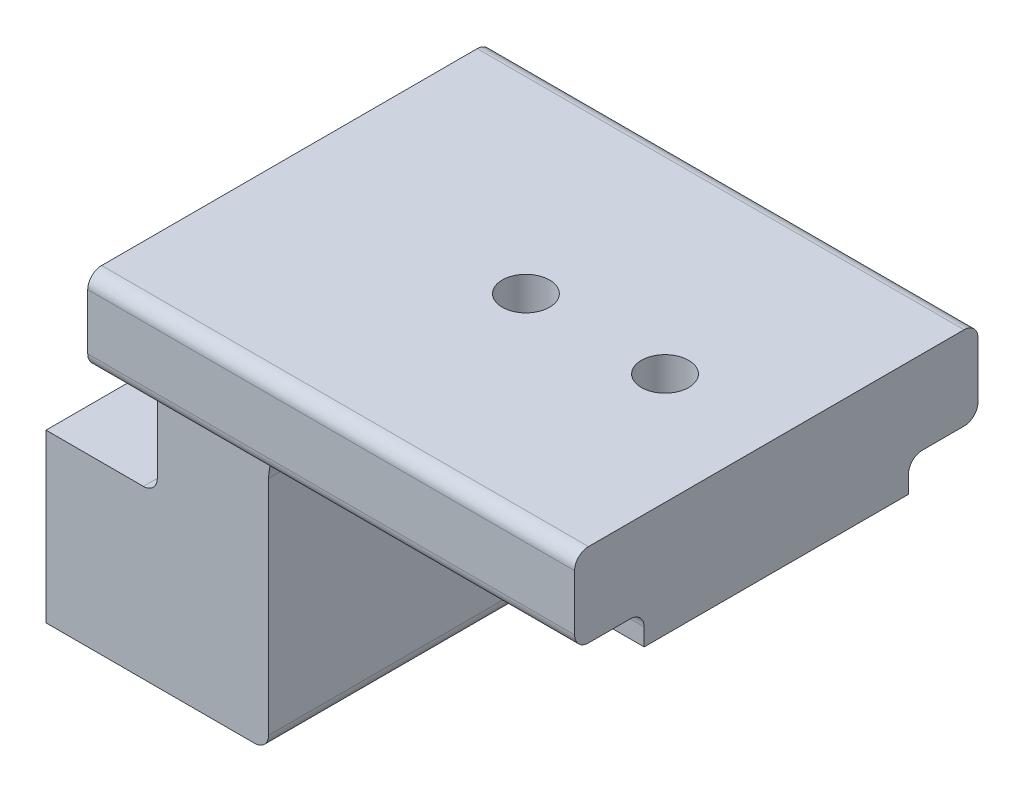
ISO-10303-21;
HEADER;
FILE_DESCRIPTION(('STEP AP214'),'2;1');
FILE_NAME('part.step','',(''),(''),'','','');
FILE_SCHEMA(('AUTOMOTIVE_DESIGN { 1 0 10303 214 1 1 1 1 }'));
ENDSEC;
DATA;
#1=APPLICATION_CONTEXT('core data for automotive mechanical design processes');
#2=APPLICATION_PROTOCOL_DEFINITION('international standard','automotive_design',2000,#1);
#3=PRODUCT_CONTEXT('',#1,'mechanical');
#4=PRODUCT('Part','Part','',(#3));
#5=PRODUCT_RELATED_PRODUCT_CATEGORY('part','',(#4));
#6=PRODUCT_DEFINITION_FORMATION('','',#4);
#7=PRODUCT_DEFINITION_CONTEXT('part definition',#1,'design');
#8=PRODUCT_DEFINITION('design','',#6,#7);
#9=PRODUCT_DEFINITION_SHAPE('','',#8);
#10=(LENGTH_UNIT() NAMED_UNIT(*) SI_UNIT(.MILLI.,.METRE.));
#11=(NAMED_UNIT(*) PLANE_ANGLE_UNIT() SI_UNIT($,.RADIAN.));
#12=(NAMED_UNIT(*) SI_UNIT($,.STERADIAN.) SOLID_ANGLE_UNIT());
#13=UNCERTAINTY_MEASURE_WITH_UNIT(LENGTH_MEASURE(1.E-05),#10,'distance_accuracy_value','');
#14=(GEOMETRIC_REPRESENTATION_CONTEXT(3) GLOBAL_UNCERTAINTY_ASSIGNED_CONTEXT((#13)) GLOBAL_UNIT_ASSIGNED_CONTEXT((#10,
#11,#12)) REPRESENTATION_CONTEXT('',''));
#15=CARTESIAN_POINT('',(0.,0.,0.));
#16=DIRECTION('',(0.,0.,1.));
#17=DIRECTION('',(1.,0.,0.));
#18=AXIS2_PLACEMENT_3D('',#15,#16,#17);
#19=CARTESIAN_POINT('',(0.,0.,0.));
#20=DIRECTION('',(1.,0.,0.));
#21=DIRECTION('',(0.,0.,-1.));
#22=AXIS2_PLACEMENT_3D('',#19,#20,#21);
#23=PLANE('',#22);
#24=CARTESIAN_POINT('',(0.,0.,5.));
#25=DIRECTION('',(1.,0.,0.));
#26=DIRECTION('',(0.,0.,-1.));
#27=AXIS2_PLACEMENT_3D('',#24,#25,#26);
#28=CIRCLE('',#27,1.25);
#29=CARTESIAN_POINT('',(0.,0.,3.75));
#30=VERTEX_POINT('',#29);
#31=EDGE_CURVE('E378',#30,#30,#28,.F.);
#32=ORIENTED_EDGE('',*,*,#31,.F.);
#33=EDGE_LOOP('',(#32));
#34=FACE_BOUND('',#33,.T.);
#35=CARTESIAN_POINT('',(0.,0.,-5.));
#36=DIRECTION('',(1.,0.,0.));
#37=DIRECTION('',(0.,0.,-1.));
#38=AXIS2_PLACEMENT_3D('',#35,#36,#37);
#39=CIRCLE('',#38,1.25);
#40=CARTESIAN_POINT('',(0.,0.,-6.25));
#41=VERTEX_POINT('',#40);
#42=EDGE_CURVE('E375',#41,#41,#39,.F.);
#43=ORIENTED_EDGE('',*,*,#42,.F.);
#44=EDGE_LOOP('',(#43));
#45=FACE_BOUND('',#44,.T.);
#46=DIRECTION('',(0.,0.,1.));
#47=VECTOR('',#46,1.);
#48=CARTESIAN_POINT('',(0.,6.,10.));
#49=LINE('',#48,#47);
#50=CARTESIAN_POINT('',(0.,6.,-9.5));
#51=VERTEX_POINT('',#50);
#52=CARTESIAN_POINT('',(0.,6.,9.5));
#53=VERTEX_POINT('',#52);
#54=EDGE_CURVE('E42',#51,#53,#49,.T.);
#55=ORIENTED_EDGE('',*,*,#54,.F.);
#56=DIRECTION('',(0.,-1.,0.));
#57=VECTOR('',#56,1.);
#58=CARTESIAN_POINT('',(0.,0.,-9.5));
#59=LINE('',#58,#57);
#60=CARTESIAN_POINT('',(0.,-6.,-9.5));
#61=VERTEX_POINT('',#60);
#62=EDGE_CURVE('E11',#51,#61,#59,.T.);
#63=ORIENTED_EDGE('',*,*,#62,.T.);
#64=DIRECTION('',(0.,0.,-1.));
#65=VECTOR('',#64,1.);
#66=CARTESIAN_POINT('',(0.,-6.,10.));
#67=LINE('',#66,#65);
#68=CARTESIAN_POINT('',(0.,-6.,9.5));
#69=VERTEX_POINT('',#68);
#70=EDGE_CURVE('E225',#69,#61,#67,.T.);
#71=ORIENTED_EDGE('',*,*,#70,.F.);
#72=DIRECTION('',(0.,-1.,0.));
#73=VECTOR('',#72,1.);
#74=CARTESIAN_POINT('',(0.,0.,9.5));
#75=LINE('',#74,#73);
#76=EDGE_CURVE('E59',#53,#69,#75,.T.);
#77=ORIENTED_EDGE('',*,*,#76,.F.);
#78=EDGE_LOOP('',(#55,#63,#71,#77));
#79=FACE_BOUND('',#78,.T.);
#80=ADVANCED_FACE('F39',(#34,#45,#79),#23,.F.);
#81=CARTESIAN_POINT('',(4.24892422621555,0.,-5.));
#82=DIRECTION('',(-1.,0.,0.));
#83=DIRECTION('',(0.,0.,1.));
#84=AXIS2_PLACEMENT_3D('',#81,#82,#83);
#85=CONICAL_SURFACE('',#84,1.25,1.02974425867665);
#86=CARTESIAN_POINT('',(5.,0.,-5.));
#87=VERTEX_POINT('',#86);
#88=VERTEX_LOOP('',#87);
#89=FACE_BOUND('',#88,.T.);
#90=CARTESIAN_POINT('',(4.24892422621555,0.,-5.));
#91=DIRECTION('',(-1.,0.,0.));
#92=DIRECTION('',(0.,0.,1.));
#93=AXIS2_PLACEMENT_3D('',#90,#91,#92);
#94=CIRCLE('',#93,1.25);
#95=CARTESIAN_POINT('',(4.24892422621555,0.,-3.75));
#96=VERTEX_POINT('',#95);
#97=EDGE_CURVE('E193',#96,#96,#94,.T.);
#98=ORIENTED_EDGE('',*,*,#97,.T.);
#99=EDGE_LOOP('',(#98));
#100=FACE_BOUND('',#99,.T.);
#101=ADVANCED_FACE('F186',(#89,#100),#85,.F.);
#102=CARTESIAN_POINT('',(-9.,0.,-5.));
#103=DIRECTION('',(-1.,0.,0.));
#104=DIRECTION('',(0.,0.,1.));
#105=AXIS2_PLACEMENT_3D('',#102,#103,#104);
#106=CYLINDRICAL_SURFACE('',#105,1.25);
#107=ORIENTED_EDGE('',*,*,#42,.T.);
#108=EDGE_LOOP('',(#107));
#109=FACE_BOUND('',#108,.T.);
#110=ORIENTED_EDGE('',*,*,#97,.F.);
#111=EDGE_LOOP('',(#110));
#112=FACE_BOUND('',#111,.T.);
#113=ADVANCED_FACE('F189',(#109,#112),#106,.F.);
#114=CARTESIAN_POINT('',(4.24892422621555,0.,5.));
#115=DIRECTION('',(-1.,0.,0.));
#116=DIRECTION('',(0.,0.,1.));
#117=AXIS2_PLACEMENT_3D('',#114,#115,#116);
#118=CONICAL_SURFACE('',#117,1.25,1.02974425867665);
#119=CARTESIAN_POINT('',(5.,0.,5.));
#120=VERTEX_POINT('',#119);
#121=VERTEX_LOOP('',#120);
#122=FACE_BOUND('',#121,.T.);
#123=CARTESIAN_POINT('',(4.24892422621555,0.,5.));
#124=DIRECTION('',(-1.,0.,0.));
#125=DIRECTION('',(0.,0.,1.));
#126=AXIS2_PLACEMENT_3D('',#123,#124,#125);
#127=CIRCLE('',#126,1.25);
#128=CARTESIAN_POINT('',(4.24892422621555,0.,6.24999999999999));
#129=VERTEX_POINT('',#128);
#130=EDGE_CURVE('E195',#129,#129,#127,.T.);
#131=ORIENTED_EDGE('',*,*,#130,.T.);
#132=EDGE_LOOP('',(#131));
#133=FACE_BOUND('',#132,.T.);
#134=ADVANCED_FACE('F549',(#122,#133),#118,.F.);
#135=CARTESIAN_POINT('',(-9.,0.,5.));
#136=DIRECTION('',(-1.,0.,0.));
#137=DIRECTION('',(0.,0.,1.));
#138=AXIS2_PLACEMENT_3D('',#135,#136,#137);
#139=CYLINDRICAL_SURFACE('',#138,1.25);
#140=ORIENTED_EDGE('',*,*,#31,.T.);
#141=EDGE_LOOP('',(#140));
#142=FACE_BOUND('',#141,.T.);
#143=ORIENTED_EDGE('',*,*,#130,.F.);
#144=EDGE_LOOP('',(#143));
#145=FACE_BOUND('',#144,.T.);
#146=ADVANCED_FACE('F514',(#142,#145),#139,.F.);
#147=CARTESIAN_POINT('',(16.,14.,10.));
#148=DIRECTION('',(-1.,0.,0.));
#149=DIRECTION('',(0.,0.,1.));
#150=AXIS2_PLACEMENT_3D('',#147,#148,#149);
#151=PLANE('',#150);
#152=DIRECTION('',(0.,1.,0.));
#153=VECTOR('',#152,1.);
#154=CARTESIAN_POINT('',(16.,0.,-9.5));
#155=LINE('',#154,#153);
#156=CARTESIAN_POINT('',(16.,-5.,-9.5));
#157=VERTEX_POINT('',#156);
#158=CARTESIAN_POINT('',(16.,11.,-9.5));
#159=VERTEX_POINT('',#158);
#160=EDGE_CURVE('E254',#157,#159,#155,.T.);
#161=ORIENTED_EDGE('',*,*,#160,.T.);
#162=DIRECTION('',(0.,0.,-1.));
#163=VECTOR('',#162,1.);
#164=CARTESIAN_POINT('',(16.,11.,10.));
#165=LINE('',#164,#163);
#166=CARTESIAN_POINT('',(16.,11.,9.5));
#167=VERTEX_POINT('',#166);
#168=EDGE_CURVE('E369',#159,#167,#165,.F.);
#169=ORIENTED_EDGE('',*,*,#168,.T.);
#170=DIRECTION('',(0.,1.,0.));
#171=VECTOR('',#170,1.);
#172=CARTESIAN_POINT('',(16.,0.,9.5));
#173=LINE('',#172,#171);
#174=CARTESIAN_POINT('',(16.,-5.,9.5));
#175=VERTEX_POINT('',#174);
#176=EDGE_CURVE('E235',#175,#167,#173,.T.);
#177=ORIENTED_EDGE('',*,*,#176,.F.);
#178=DIRECTION('',(0.,0.,-1.));
#179=VECTOR('',#178,1.);
#180=CARTESIAN_POINT('',(16.,-5.,10.));
#181=LINE('',#180,#179);
#182=EDGE_CURVE('E227',#175,#157,#181,.T.);
#183=ORIENTED_EDGE('',*,*,#182,.T.);
#184=EDGE_LOOP('',(#161,#169,#177,#183));
#185=FACE_BOUND('',#184,.T.);
#186=ADVANCED_FACE('F458',(#185),#151,.F.);
#187=CARTESIAN_POINT('',(8.,6.,10.));
#188=DIRECTION('',(1.,0.,0.));
#189=DIRECTION('',(0.,0.,-1.));
#190=AXIS2_PLACEMENT_3D('',#187,#188,#189);
#191=PLANE('',#190);
#192=DIRECTION('',(0.,-1.,0.));
#193=VECTOR('',#192,1.);
#194=CARTESIAN_POINT('',(8.,0.,-9.5));
#195=LINE('',#194,#193);
#196=CARTESIAN_POINT('',(8.,15.25,-9.5));
#197=VERTEX_POINT('',#196);
#198=CARTESIAN_POINT('',(8.,7.,-9.5));
#199=VERTEX_POINT('',#198);
#200=EDGE_CURVE('E250',#197,#199,#195,.T.);
#201=ORIENTED_EDGE('',*,*,#200,.T.);
#202=DIRECTION('',(0.,0.,-1.));
#203=VECTOR('',#202,1.);
#204=CARTESIAN_POINT('',(8.,7.,9.5));
#205=LINE('',#204,#203);
#206=CARTESIAN_POINT('',(8.,7.,9.5));
#207=VERTEX_POINT('',#206);
#208=EDGE_CURVE('E319',#199,#207,#205,.F.);
#209=ORIENTED_EDGE('',*,*,#208,.T.);
#210=DIRECTION('',(0.,-1.,0.));
#211=VECTOR('',#210,1.);
#212=CARTESIAN_POINT('',(8.,0.,9.5));
#213=LINE('',#212,#211);
#214=CARTESIAN_POINT('',(8.,15.25,9.5));
#215=VERTEX_POINT('',#214);
#216=EDGE_CURVE('E232',#215,#207,#213,.T.);
#217=ORIENTED_EDGE('',*,*,#216,.F.);
#218=CARTESIAN_POINT('',(8.,15.25,10.5));
#219=DIRECTION('',(1.,0.,0.));
#220=DIRECTION('',(0.,0.,-1.));
#221=AXIS2_PLACEMENT_3D('',#218,#219,#220);
#222=CIRCLE('',#221,1.);
#223=CARTESIAN_POINT('',(8.,16.25,10.5));
#224=VERTEX_POINT('',#223);
#225=EDGE_CURVE('E362',#215,#224,#222,.T.);
#226=ORIENTED_EDGE('',*,*,#225,.T.);
#227=DIRECTION('',(0.,0.,-1.));
#228=VECTOR('',#227,1.);
#229=CARTESIAN_POINT('',(8.,16.25,10.));
#230=LINE('',#229,#228);
#231=CARTESIAN_POINT('',(8.,16.25,13.5));
#232=VERTEX_POINT('',#231);
#233=EDGE_CURVE('E224',#232,#224,#230,.T.);
#234=ORIENTED_EDGE('',*,*,#233,.F.);
#235=CARTESIAN_POINT('',(8.,17.25,13.5));
#236=DIRECTION('',(1.,0.,0.));
#237=DIRECTION('',(0.,0.,-1.));
#238=AXIS2_PLACEMENT_3D('',#235,#236,#237);
#239=CIRCLE('',#238,1.);
#240=CARTESIAN_POINT('',(8.,17.25,14.5));
#241=VERTEX_POINT('',#240);
#242=EDGE_CURVE('E311',#232,#241,#239,.F.);
#243=ORIENTED_EDGE('',*,*,#242,.T.);
#244=DIRECTION('',(0.,-1.,0.));
#245=VECTOR('',#244,1.);
#246=CARTESIAN_POINT('',(8.,6.,14.5));
#247=LINE('',#246,#245);
#248=CARTESIAN_POINT('',(8.,21.25,14.5));
#249=VERTEX_POINT('',#248);
#250=EDGE_CURVE('E238',#249,#241,#247,.T.);
#251=ORIENTED_EDGE('',*,*,#250,.F.);
#252=CARTESIAN_POINT('',(8.,21.25,13.5));
#253=DIRECTION('',(1.,0.,0.));
#254=DIRECTION('',(0.,0.,-1.));
#255=AXIS2_PLACEMENT_3D('',#252,#253,#254);
#256=CIRCLE('',#255,1.);
#257=CARTESIAN_POINT('',(8.,22.25,13.5));
#258=VERTEX_POINT('',#257);
#259=EDGE_CURVE('E313',#249,#258,#256,.F.);
#260=ORIENTED_EDGE('',*,*,#259,.T.);
#261=DIRECTION('',(0.,0.,1.));
#262=VECTOR('',#261,1.);
#263=CARTESIAN_POINT('',(8.,22.25,10.));
#264=LINE('',#263,#262);
#265=CARTESIAN_POINT('',(8.,22.25,-13.5));
#266=VERTEX_POINT('',#265);
#267=EDGE_CURVE('E241',#266,#258,#264,.T.);
#268=ORIENTED_EDGE('',*,*,#267,.F.);
#269=CARTESIAN_POINT('',(8.,21.25,-13.5));
#270=DIRECTION('',(1.,0.,0.));
#271=DIRECTION('',(0.,0.,-1.));
#272=AXIS2_PLACEMENT_3D('',#269,#270,#271);
#273=CIRCLE('',#272,1.);
#274=CARTESIAN_POINT('',(8.,21.25,-14.5));
#275=VERTEX_POINT('',#274);
#276=EDGE_CURVE('E315',#266,#275,#273,.F.);
#277=ORIENTED_EDGE('',*,*,#276,.T.);
#278=DIRECTION('',(0.,1.,0.));
#279=VECTOR('',#278,1.);
#280=CARTESIAN_POINT('',(8.,6.,-14.5));
#281=LINE('',#280,#279);
#282=CARTESIAN_POINT('',(8.,17.25,-14.5));
#283=VERTEX_POINT('',#282);
#284=EDGE_CURVE('E244',#283,#275,#281,.T.);
#285=ORIENTED_EDGE('',*,*,#284,.F.);
#286=CARTESIAN_POINT('',(8.,17.25,-13.5));
#287=DIRECTION('',(1.,0.,0.));
#288=DIRECTION('',(0.,0.,-1.));
#289=AXIS2_PLACEMENT_3D('',#286,#287,#288);
#290=CIRCLE('',#289,1.);
#291=CARTESIAN_POINT('',(8.,16.25,-13.5));
#292=VERTEX_POINT('',#291);
#293=EDGE_CURVE('E317',#283,#292,#290,.F.);
#294=ORIENTED_EDGE('',*,*,#293,.T.);
#295=DIRECTION('',(0.,0.,-1.));
#296=VECTOR('',#295,1.);
#297=CARTESIAN_POINT('',(8.,16.25,10.));
#298=LINE('',#297,#296);
#299=CARTESIAN_POINT('',(8.,16.25,-10.5));
#300=VERTEX_POINT('',#299);
#301=EDGE_CURVE('E247',#300,#292,#298,.T.);
#302=ORIENTED_EDGE('',*,*,#301,.F.);
#303=CARTESIAN_POINT('',(8.,15.25,-10.5));
#304=DIRECTION('',(1.,0.,0.));
#305=DIRECTION('',(0.,0.,-1.));
#306=AXIS2_PLACEMENT_3D('',#303,#304,#305);
#307=CIRCLE('',#306,1.);
#308=EDGE_CURVE('E358',#300,#197,#307,.T.);
#309=ORIENTED_EDGE('',*,*,#308,.T.);
#310=EDGE_LOOP('',(#201,#209,#217,#226,#234,#243,#251,#260,#268,#277,#285,#294,#302,#309));
#311=FACE_BOUND('',#310,.T.);
#312=ADVANCED_FACE('F395',(#311),#191,.F.);
#313=CARTESIAN_POINT('',(0.,6.,10.));
#314=DIRECTION('',(0.,-1.,0.));
#315=DIRECTION('',(0.,0.,-1.));
#316=AXIS2_PLACEMENT_3D('',#313,#314,#315);
#317=PLANE('',#316);
#318=DIRECTION('',(-1.,0.,0.));
#319=VECTOR('',#318,1.);
#320=CARTESIAN_POINT('',(0.,6.,-9.5));
#321=LINE('',#320,#319);
#322=CARTESIAN_POINT('',(7.,6.,-9.5));
#323=VERTEX_POINT('',#322);
#324=EDGE_CURVE('E253',#323,#51,#321,.T.);
#325=ORIENTED_EDGE('',*,*,#324,.T.);
#326=ORIENTED_EDGE('',*,*,#54,.T.);
#327=DIRECTION('',(-1.,0.,0.));
#328=VECTOR('',#327,1.);
#329=CARTESIAN_POINT('',(0.,6.,9.5));
#330=LINE('',#329,#328);
#331=CARTESIAN_POINT('',(7.,6.,9.5));
#332=VERTEX_POINT('',#331);
#333=EDGE_CURVE('E229',#332,#53,#330,.T.);
#334=ORIENTED_EDGE('',*,*,#333,.F.);
#335=DIRECTION('',(0.,0.,-1.));
#336=VECTOR('',#335,1.);
#337=CARTESIAN_POINT('',(7.,6.,-9.5));
#338=LINE('',#337,#336);
#339=EDGE_CURVE('E308',#332,#323,#338,.T.);
#340=ORIENTED_EDGE('',*,*,#339,.T.);
#341=EDGE_LOOP('',(#325,#326,#334,#340));
#342=FACE_BOUND('',#341,.T.);
#343=ADVANCED_FACE('F383',(#342),#317,.F.);
#344=CARTESIAN_POINT('',(16.,-6.,10.));
#345=DIRECTION('',(0.,1.,0.));
#346=DIRECTION('',(0.,0.,1.));
#347=AXIS2_PLACEMENT_3D('',#344,#345,#346);
#348=PLANE('',#347);
#349=DIRECTION('',(1.,0.,0.));
#350=VECTOR('',#349,1.);
#351=CARTESIAN_POINT('',(0.,-6.,-9.5));
#352=LINE('',#351,#350);
#353=CARTESIAN_POINT('',(15.,-6.,-9.5));
#354=VERTEX_POINT('',#353);
#355=EDGE_CURVE('E257',#61,#354,#352,.T.);
#356=ORIENTED_EDGE('',*,*,#355,.T.);
#357=DIRECTION('',(0.,0.,-1.));
#358=VECTOR('',#357,1.);
#359=CARTESIAN_POINT('',(15.,-6.,10.));
#360=LINE('',#359,#358);
#361=CARTESIAN_POINT('',(15.,-6.,9.5));
#362=VERTEX_POINT('',#361);
#363=EDGE_CURVE('E301',#354,#362,#360,.F.);
#364=ORIENTED_EDGE('',*,*,#363,.T.);
#365=DIRECTION('',(1.,0.,0.));
#366=VECTOR('',#365,1.);
#367=CARTESIAN_POINT('',(0.,-6.,9.5));
#368=LINE('',#367,#366);
#369=EDGE_CURVE('E228',#69,#362,#368,.T.);
#370=ORIENTED_EDGE('',*,*,#369,.F.);
#371=ORIENTED_EDGE('',*,*,#70,.T.);
#372=EDGE_LOOP('',(#356,#364,#370,#371));
#373=FACE_BOUND('',#372,.T.);
#374=ADVANCED_FACE('F468',(#373),#348,.F.);
#375=CARTESIAN_POINT('',(0.,0.,9.5));
#376=DIRECTION('',(0.,0.,-1.));
#377=DIRECTION('',(-1.,0.,0.));
#378=AXIS2_PLACEMENT_3D('',#375,#376,#377);
#379=PLANE('',#378);
#380=ORIENTED_EDGE('',*,*,#333,.T.);
#381=ORIENTED_EDGE('',*,*,#76,.T.);
#382=ORIENTED_EDGE('',*,*,#369,.T.);
#383=CARTESIAN_POINT('',(15.,-5.,9.5));
#384=DIRECTION('',(0.,0.,-1.));
#385=DIRECTION('',(-1.,0.,0.));
#386=AXIS2_PLACEMENT_3D('',#383,#384,#385);
#387=CIRCLE('',#386,1.);
#388=EDGE_CURVE('E306',#362,#175,#387,.F.);
#389=ORIENTED_EDGE('',*,*,#388,.T.);
#390=ORIENTED_EDGE('',*,*,#176,.T.);
#391=CARTESIAN_POINT('',(19.,11.,9.5));
#392=DIRECTION('',(0.,0.,-1.));
#393=DIRECTION('',(-1.,0.,0.));
#394=AXIS2_PLACEMENT_3D('',#391,#392,#393);
#395=CIRCLE('',#394,3.);
#396=CARTESIAN_POINT('',(19.,14.,9.5));
#397=VERTEX_POINT('',#396);
#398=EDGE_CURVE('E373',#167,#397,#395,.T.);
#399=ORIENTED_EDGE('',*,*,#398,.T.);
#400=DIRECTION('',(-1.,0.,0.));
#401=VECTOR('',#400,1.);
#402=CARTESIAN_POINT('',(0.,14.,9.5));
#403=LINE('',#402,#401);
#404=CARTESIAN_POINT('',(43.,14.,9.5));
#405=VERTEX_POINT('',#404);
#406=EDGE_CURVE('E265',#405,#397,#403,.T.);
#407=ORIENTED_EDGE('',*,*,#406,.F.);
#408=DIRECTION('',(0.,1.,0.));
#409=VECTOR('',#408,1.);
#410=CARTESIAN_POINT('',(43.,0.,9.5));
#411=LINE('',#410,#409);
#412=CARTESIAN_POINT('',(43.,15.25,9.5));
#413=VERTEX_POINT('',#412);
#414=EDGE_CURVE('E223',#405,#413,#411,.T.);
#415=ORIENTED_EDGE('',*,*,#414,.T.);
#416=DIRECTION('',(-1.,0.,0.));
#417=VECTOR('',#416,1.);
#418=CARTESIAN_POINT('',(0.,15.25,9.5));
#419=LINE('',#418,#417);
#420=EDGE_CURVE('E303',#413,#215,#419,.T.);
#421=ORIENTED_EDGE('',*,*,#420,.T.);
#422=ORIENTED_EDGE('',*,*,#216,.T.);
#423=CARTESIAN_POINT('',(7.,7.,9.5));
#424=DIRECTION('',(0.,0.,-1.));
#425=DIRECTION('',(-1.,0.,0.));
#426=AXIS2_PLACEMENT_3D('',#423,#424,#425);
#427=CIRCLE('',#426,1.);
#428=EDGE_CURVE('E356',#207,#332,#427,.T.);
#429=ORIENTED_EDGE('',*,*,#428,.T.);
#430=EDGE_LOOP('',(#380,#381,#382,#389,#390,#399,#407,#415,#421,#422,#429));
#431=FACE_BOUND('',#430,.T.);
#432=ADVANCED_FACE('F385',(#431),#379,.F.);
#433=CARTESIAN_POINT('',(0.,0.,-9.5));
#434=DIRECTION('',(0.,0.,-1.));
#435=DIRECTION('',(-1.,0.,0.));
#436=AXIS2_PLACEMENT_3D('',#433,#434,#435);
#437=PLANE('',#436);
#438=ORIENTED_EDGE('',*,*,#62,.F.);
#439=ORIENTED_EDGE('',*,*,#324,.F.);
#440=CARTESIAN_POINT('',(7.,7.,-9.5));
#441=DIRECTION('',(0.,0.,-1.));
#442=DIRECTION('',(-1.,0.,0.));
#443=AXIS2_PLACEMENT_3D('',#440,#441,#442);
#444=CIRCLE('',#443,1.);
#445=EDGE_CURVE('E354',#323,#199,#444,.F.);
#446=ORIENTED_EDGE('',*,*,#445,.T.);
#447=ORIENTED_EDGE('',*,*,#200,.F.);
#448=DIRECTION('',(-1.,0.,0.));
#449=VECTOR('',#448,1.);
#450=CARTESIAN_POINT('',(43.,15.25,-9.5));
#451=LINE('',#450,#449);
#452=CARTESIAN_POINT('',(43.,15.25,-9.5));
#453=VERTEX_POINT('',#452);
#454=EDGE_CURVE('E297',#197,#453,#451,.F.);
#455=ORIENTED_EDGE('',*,*,#454,.T.);
#456=DIRECTION('',(0.,-1.,0.));
#457=VECTOR('',#456,1.);
#458=CARTESIAN_POINT('',(43.,0.,-9.5));
#459=LINE('',#458,#457);
#460=CARTESIAN_POINT('',(43.,14.,-9.5));
#461=VERTEX_POINT('',#460);
#462=EDGE_CURVE('E266',#453,#461,#459,.T.);
#463=ORIENTED_EDGE('',*,*,#462,.T.);
#464=DIRECTION('',(-1.,0.,0.));
#465=VECTOR('',#464,1.);
#466=CARTESIAN_POINT('',(0.,14.,-9.5));
#467=LINE('',#466,#465);
#468=CARTESIAN_POINT('',(19.,14.,-9.5));
#469=VERTEX_POINT('',#468);
#470=EDGE_CURVE('E262',#461,#469,#467,.T.);
#471=ORIENTED_EDGE('',*,*,#470,.T.);
#472=CARTESIAN_POINT('',(19.,11.,-9.5));
#473=DIRECTION('',(0.,0.,-1.));
#474=DIRECTION('',(-1.,0.,0.));
#475=AXIS2_PLACEMENT_3D('',#472,#473,#474);
#476=CIRCLE('',#475,3.);
#477=EDGE_CURVE('E371',#469,#159,#476,.F.);
#478=ORIENTED_EDGE('',*,*,#477,.T.);
#479=ORIENTED_EDGE('',*,*,#160,.F.);
#480=CARTESIAN_POINT('',(15.,-5.,-9.5));
#481=DIRECTION('',(0.,0.,-1.));
#482=DIRECTION('',(-1.,0.,0.));
#483=AXIS2_PLACEMENT_3D('',#480,#481,#482);
#484=CIRCLE('',#483,1.);
#485=EDGE_CURVE('E299',#157,#354,#484,.T.);
#486=ORIENTED_EDGE('',*,*,#485,.T.);
#487=ORIENTED_EDGE('',*,*,#355,.F.);
#488=EDGE_LOOP('',(#438,#439,#446,#447,#455,#463,#471,#478,#479,#486,#487));
#489=FACE_BOUND('',#488,.T.);
#490=ADVANCED_FACE('F391',(#489),#437,.T.);
#491=CARTESIAN_POINT('',(43.,14.,10.));
#492=DIRECTION('',(0.,-1.,0.));
#493=DIRECTION('',(1.,0.,0.));
#494=AXIS2_PLACEMENT_3D('',#491,#492,#493);
#495=PLANE('',#494);
#496=CARTESIAN_POINT('',(25.,14.,0.));
#497=DIRECTION('',(0.,-1.,0.));
#498=DIRECTION('',(0.,0.,-1.));
#499=AXIS2_PLACEMENT_3D('',#496,#497,#498);
#500=CIRCLE('',#499,3.25);
#501=CARTESIAN_POINT('',(25.,14.,-3.25));
#502=VERTEX_POINT('',#501);
#503=EDGE_CURVE('E198',#502,#502,#500,.T.);
#504=ORIENTED_EDGE('',*,*,#503,.F.);
#505=EDGE_LOOP('',(#504));
#506=FACE_BOUND('',#505,.T.);
#507=CARTESIAN_POINT('',(35.,14.,0.));
#508=DIRECTION('',(0.,-1.,0.));
#509=DIRECTION('',(0.,0.,-1.));
#510=AXIS2_PLACEMENT_3D('',#507,#508,#509);
#511=CIRCLE('',#510,3.25);
#512=CARTESIAN_POINT('',(35.,14.,-3.25));
#513=VERTEX_POINT('',#512);
#514=EDGE_CURVE('E210',#513,#513,#511,.T.);
#515=ORIENTED_EDGE('',*,*,#514,.F.);
#516=EDGE_LOOP('',(#515));
#517=FACE_BOUND('',#516,.T.);
#518=ORIENTED_EDGE('',*,*,#406,.T.);
#519=DIRECTION('',(0.,0.,-1.));
#520=VECTOR('',#519,1.);
#521=CARTESIAN_POINT('',(19.,14.,10.));
#522=LINE('',#521,#520);
#523=EDGE_CURVE('E366',#397,#469,#522,.T.);
#524=ORIENTED_EDGE('',*,*,#523,.T.);
#525=ORIENTED_EDGE('',*,*,#470,.F.);
#526=DIRECTION('',(0.,0.,1.));
#527=VECTOR('',#526,1.);
#528=CARTESIAN_POINT('',(43.,14.,10.));
#529=LINE('',#528,#527);
#530=EDGE_CURVE('E220',#461,#405,#529,.T.);
#531=ORIENTED_EDGE('',*,*,#530,.T.);
#532=EDGE_LOOP('',(#518,#524,#525,#531));
#533=FACE_BOUND('',#532,.T.);
#534=ADVANCED_FACE('F452',(#506,#517,#533),#495,.T.);
#535=CARTESIAN_POINT('',(43.,16.25,10.));
#536=DIRECTION('',(0.,-1.,0.));
#537=DIRECTION('',(1.,0.,0.));
#538=AXIS2_PLACEMENT_3D('',#535,#536,#537);
#539=PLANE('',#538);
#540=DIRECTION('',(0.,0.,1.));
#541=VECTOR('',#540,1.);
#542=CARTESIAN_POINT('',(43.,16.25,0.));
#543=LINE('',#542,#541);
#544=CARTESIAN_POINT('',(43.,16.25,-13.5));
#545=VERTEX_POINT('',#544);
#546=CARTESIAN_POINT('',(43.,16.25,-10.5));
#547=VERTEX_POINT('',#546);
#548=EDGE_CURVE('E268',#545,#547,#543,.T.);
#549=ORIENTED_EDGE('',*,*,#548,.T.);
#550=DIRECTION('',(-1.,0.,0.));
#551=VECTOR('',#550,1.);
#552=CARTESIAN_POINT('',(8.,16.25,-10.5));
#553=LINE('',#552,#551);
#554=EDGE_CURVE('E323',#547,#300,#553,.T.);
#555=ORIENTED_EDGE('',*,*,#554,.T.);
#556=ORIENTED_EDGE('',*,*,#301,.T.);
#557=DIRECTION('',(-1.,0.,0.));
#558=VECTOR('',#557,1.);
#559=CARTESIAN_POINT('',(43.,16.25,-13.5));
#560=LINE('',#559,#558);
#561=EDGE_CURVE('E321',#292,#545,#560,.F.);
#562=ORIENTED_EDGE('',*,*,#561,.T.);
#563=EDGE_LOOP('',(#549,#555,#556,#562));
#564=FACE_BOUND('',#563,.T.);
#565=ADVANCED_FACE('F402',(#564),#539,.T.);
#566=CARTESIAN_POINT('',(43.,14.,-14.5));
#567=DIRECTION('',(0.,0.,-1.));
#568=DIRECTION('',(-1.,0.,0.));
#569=AXIS2_PLACEMENT_3D('',#566,#567,#568);
#570=PLANE('',#569);
#571=DIRECTION('',(0.,-1.,0.));
#572=VECTOR('',#571,1.);
#573=CARTESIAN_POINT('',(43.,0.,-14.5));
#574=LINE('',#573,#572);
#575=CARTESIAN_POINT('',(43.,21.25,-14.5));
#576=VERTEX_POINT('',#575);
#577=CARTESIAN_POINT('',(43.,17.25,-14.5));
#578=VERTEX_POINT('',#577);
#579=EDGE_CURVE('E271',#576,#578,#574,.T.);
#580=ORIENTED_EDGE('',*,*,#579,.T.);
#581=DIRECTION('',(-1.,0.,0.));
#582=VECTOR('',#581,1.);
#583=CARTESIAN_POINT('',(43.,17.25,-14.5));
#584=LINE('',#583,#582);
#585=EDGE_CURVE('E328',#578,#283,#584,.T.);
#586=ORIENTED_EDGE('',*,*,#585,.T.);
#587=ORIENTED_EDGE('',*,*,#284,.T.);
#588=DIRECTION('',(-1.,0.,0.));
#589=VECTOR('',#588,1.);
#590=CARTESIAN_POINT('',(43.,21.25,-14.5));
#591=LINE('',#590,#589);
#592=EDGE_CURVE('E326',#275,#576,#591,.F.);
#593=ORIENTED_EDGE('',*,*,#592,.T.);
#594=EDGE_LOOP('',(#580,#586,#587,#593));
#595=FACE_BOUND('',#594,.T.);
#596=ADVANCED_FACE('F415',(#595),#570,.T.);
#597=CARTESIAN_POINT('',(43.,22.25,10.));
#598=DIRECTION('',(0.,1.,0.));
#599=DIRECTION('',(-1.,0.,0.));
#600=AXIS2_PLACEMENT_3D('',#597,#598,#599);
#601=PLANE('',#600);
#602=CARTESIAN_POINT('',(25.,22.25,0.));
#603=DIRECTION('',(0.,1.,0.));
#604=DIRECTION('',(-1.,0.,0.));
#605=AXIS2_PLACEMENT_3D('',#602,#603,#604);
#606=CIRCLE('',#605,1.7);
#607=CARTESIAN_POINT('',(23.3,22.25,0.));
#608=VERTEX_POINT('',#607);
#609=EDGE_CURVE('E209',#608,#608,#606,.F.);
#610=ORIENTED_EDGE('',*,*,#609,.T.);
#611=EDGE_LOOP('',(#610));
#612=FACE_BOUND('',#611,.T.);
#613=CARTESIAN_POINT('',(35.,22.25,0.));
#614=DIRECTION('',(0.,1.,0.));
#615=DIRECTION('',(-1.,0.,0.));
#616=AXIS2_PLACEMENT_3D('',#613,#614,#615);
#617=CIRCLE('',#616,1.7);
#618=CARTESIAN_POINT('',(33.3,22.25,0.));
#619=VERTEX_POINT('',#618);
#620=EDGE_CURVE('E219',#619,#619,#617,.F.);
#621=ORIENTED_EDGE('',*,*,#620,.T.);
#622=EDGE_LOOP('',(#621));
#623=FACE_BOUND('',#622,.T.);
#624=DIRECTION('',(0.,0.,-1.));
#625=VECTOR('',#624,1.);
#626=CARTESIAN_POINT('',(43.,22.25,0.));
#627=LINE('',#626,#625);
#628=CARTESIAN_POINT('',(43.,22.25,13.5));
#629=VERTEX_POINT('',#628);
#630=CARTESIAN_POINT('',(43.,22.25,-13.5));
#631=VERTEX_POINT('',#630);
#632=EDGE_CURVE('E274',#629,#631,#627,.T.);
#633=ORIENTED_EDGE('',*,*,#632,.T.);
#634=DIRECTION('',(-1.,0.,0.));
#635=VECTOR('',#634,1.);
#636=CARTESIAN_POINT('',(43.,22.25,-13.5));
#637=LINE('',#636,#635);
#638=EDGE_CURVE('E341',#631,#266,#637,.T.);
#639=ORIENTED_EDGE('',*,*,#638,.T.);
#640=ORIENTED_EDGE('',*,*,#267,.T.);
#641=DIRECTION('',(-1.,0.,0.));
#642=VECTOR('',#641,1.);
#643=CARTESIAN_POINT('',(43.,22.25,13.5));
#644=LINE('',#643,#642);
#645=EDGE_CURVE('E339',#258,#629,#644,.F.);
#646=ORIENTED_EDGE('',*,*,#645,.T.);
#647=EDGE_LOOP('',(#633,#639,#640,#646));
#648=FACE_BOUND('',#647,.T.);
#649=ADVANCED_FACE('F423',(#612,#623,#648),#601,.T.);
#650=CARTESIAN_POINT('',(43.,14.,14.5));
#651=DIRECTION('',(0.,0.,1.));
#652=DIRECTION('',(1.,0.,0.));
#653=AXIS2_PLACEMENT_3D('',#650,#651,#652);
#654=PLANE('',#653);
#655=DIRECTION('',(0.,1.,0.));
#656=VECTOR('',#655,1.);
#657=CARTESIAN_POINT('',(43.,0.,14.5));
#658=LINE('',#657,#656);
#659=CARTESIAN_POINT('',(43.,17.25,14.5));
#660=VERTEX_POINT('',#659);
#661=CARTESIAN_POINT('',(43.,21.25,14.5));
#662=VERTEX_POINT('',#661);
#663=EDGE_CURVE('E277',#660,#662,#658,.T.);
#664=ORIENTED_EDGE('',*,*,#663,.T.);
#665=DIRECTION('',(-1.,0.,0.));
#666=VECTOR('',#665,1.);
#667=CARTESIAN_POINT('',(43.,21.25,14.5));
#668=LINE('',#667,#666);
#669=EDGE_CURVE('E346',#662,#249,#668,.T.);
#670=ORIENTED_EDGE('',*,*,#669,.T.);
#671=ORIENTED_EDGE('',*,*,#250,.T.);
#672=DIRECTION('',(-1.,0.,0.));
#673=VECTOR('',#672,1.);
#674=CARTESIAN_POINT('',(43.,17.25,14.5));
#675=LINE('',#674,#673);
#676=EDGE_CURVE('E344',#241,#660,#675,.F.);
#677=ORIENTED_EDGE('',*,*,#676,.T.);
#678=EDGE_LOOP('',(#664,#670,#671,#677));
#679=FACE_BOUND('',#678,.T.);
#680=ADVANCED_FACE('F433',(#679),#654,.T.);
#681=CARTESIAN_POINT('',(43.,16.25,10.));
#682=DIRECTION('',(0.,-1.,0.));
#683=DIRECTION('',(1.,0.,0.));
#684=AXIS2_PLACEMENT_3D('',#681,#682,#683);
#685=PLANE('',#684);
#686=DIRECTION('',(0.,0.,1.));
#687=VECTOR('',#686,1.);
#688=CARTESIAN_POINT('',(43.,16.25,0.));
#689=LINE('',#688,#687);
#690=CARTESIAN_POINT('',(43.,16.25,10.5));
#691=VERTEX_POINT('',#690);
#692=CARTESIAN_POINT('',(43.,16.25,13.5));
#693=VERTEX_POINT('',#692);
#694=EDGE_CURVE('E280',#691,#693,#689,.T.);
#695=ORIENTED_EDGE('',*,*,#694,.T.);
#696=DIRECTION('',(-1.,0.,0.));
#697=VECTOR('',#696,1.);
#698=CARTESIAN_POINT('',(43.,16.25,13.5));
#699=LINE('',#698,#697);
#700=EDGE_CURVE('E351',#693,#232,#699,.T.);
#701=ORIENTED_EDGE('',*,*,#700,.T.);
#702=ORIENTED_EDGE('',*,*,#233,.T.);
#703=DIRECTION('',(-1.,0.,0.));
#704=VECTOR('',#703,1.);
#705=CARTESIAN_POINT('',(43.,16.25,10.5));
#706=LINE('',#705,#704);
#707=EDGE_CURVE('E349',#224,#691,#706,.F.);
#708=ORIENTED_EDGE('',*,*,#707,.T.);
#709=EDGE_LOOP('',(#695,#701,#702,#708));
#710=FACE_BOUND('',#709,.T.);
#711=ADVANCED_FACE('F441',(#710),#685,.T.);
#712=CARTESIAN_POINT('',(43.,0.,0.));
#713=DIRECTION('',(-1.,0.,0.));
#714=DIRECTION('',(0.,0.,1.));
#715=AXIS2_PLACEMENT_3D('',#712,#713,#714);
#716=PLANE('',#715);
#717=ORIENTED_EDGE('',*,*,#548,.F.);
#718=CARTESIAN_POINT('',(43.,17.25,-13.5));
#719=DIRECTION('',(-1.,0.,0.));
#720=DIRECTION('',(0.,0.,1.));
#721=AXIS2_PLACEMENT_3D('',#718,#719,#720);
#722=CIRCLE('',#721,1.);
#723=EDGE_CURVE('E337',#545,#578,#722,.F.);
#724=ORIENTED_EDGE('',*,*,#723,.T.);
#725=ORIENTED_EDGE('',*,*,#579,.F.);
#726=CARTESIAN_POINT('',(43.,21.25,-13.5));
#727=DIRECTION('',(-1.,0.,0.));
#728=DIRECTION('',(0.,0.,1.));
#729=AXIS2_PLACEMENT_3D('',#726,#727,#728);
#730=CIRCLE('',#729,1.);
#731=EDGE_CURVE('E335',#576,#631,#730,.F.);
#732=ORIENTED_EDGE('',*,*,#731,.T.);
#733=ORIENTED_EDGE('',*,*,#632,.F.);
#734=CARTESIAN_POINT('',(43.,21.25,13.5));
#735=DIRECTION('',(-1.,0.,0.));
#736=DIRECTION('',(0.,0.,1.));
#737=AXIS2_PLACEMENT_3D('',#734,#735,#736);
#738=CIRCLE('',#737,1.);
#739=EDGE_CURVE('E333',#629,#662,#738,.F.);
#740=ORIENTED_EDGE('',*,*,#739,.T.);
#741=ORIENTED_EDGE('',*,*,#663,.F.);
#742=CARTESIAN_POINT('',(43.,17.25,13.5));
#743=DIRECTION('',(-1.,0.,0.));
#744=DIRECTION('',(0.,0.,1.));
#745=AXIS2_PLACEMENT_3D('',#742,#743,#744);
#746=CIRCLE('',#745,1.);
#747=EDGE_CURVE('E331',#660,#693,#746,.F.);
#748=ORIENTED_EDGE('',*,*,#747,.T.);
#749=ORIENTED_EDGE('',*,*,#694,.F.);
#750=CARTESIAN_POINT('',(43.,15.25,10.5));
#751=DIRECTION('',(-1.,0.,0.));
#752=DIRECTION('',(0.,0.,1.));
#753=AXIS2_PLACEMENT_3D('',#750,#751,#752);
#754=CIRCLE('',#753,1.);
#755=EDGE_CURVE('E364',#691,#413,#754,.T.);
#756=ORIENTED_EDGE('',*,*,#755,.T.);
#757=ORIENTED_EDGE('',*,*,#414,.F.);
#758=ORIENTED_EDGE('',*,*,#530,.F.);
#759=ORIENTED_EDGE('',*,*,#462,.F.);
#760=CARTESIAN_POINT('',(43.,15.25,-10.5));
#761=DIRECTION('',(-1.,0.,0.));
#762=DIRECTION('',(0.,0.,1.));
#763=AXIS2_PLACEMENT_3D('',#760,#761,#762);
#764=CIRCLE('',#763,1.);
#765=EDGE_CURVE('E360',#453,#547,#764,.T.);
#766=ORIENTED_EDGE('',*,*,#765,.T.);
#767=EDGE_LOOP('',(#717,#724,#725,#732,#733,#740,#741,#748,#749,#756,#757,#758,#759,#766));
#768=FACE_BOUND('',#767,.T.);
#769=ADVANCED_FACE('F407',(#768),#716,.F.);
#770=CARTESIAN_POINT('',(35.,14.,0.));
#771=DIRECTION('',(0.,-1.,0.));
#772=DIRECTION('',(0.,0.,-1.));
#773=AXIS2_PLACEMENT_3D('',#770,#771,#772);
#774=CYLINDRICAL_SURFACE('',#773,1.7);
#775=ORIENTED_EDGE('',*,*,#620,.F.);
#776=EDGE_LOOP('',(#775));
#777=FACE_BOUND('',#776,.T.);
#778=CARTESIAN_POINT('',(35.,17.,0.));
#779=DIRECTION('',(0.,-1.,0.));
#780=DIRECTION('',(0.,0.,-1.));
#781=AXIS2_PLACEMENT_3D('',#778,#779,#780);
#782=CIRCLE('',#781,1.7);
#783=CARTESIAN_POINT('',(35.,17.,-1.7));
#784=VERTEX_POINT('',#783);
#785=EDGE_CURVE('E216',#784,#784,#782,.T.);
#786=ORIENTED_EDGE('',*,*,#785,.T.);
#787=EDGE_LOOP('',(#786));
#788=FACE_BOUND('',#787,.T.);
#789=ADVANCED_FACE('F526',(#777,#788),#774,.F.);
#790=CARTESIAN_POINT('',(36.7,17.,0.));
#791=DIRECTION('',(0.,1.,0.));
#792=DIRECTION('',(0.,0.,1.));
#793=AXIS2_PLACEMENT_3D('',#790,#791,#792);
#794=PLANE('',#793);
#795=ORIENTED_EDGE('',*,*,#785,.F.);
#796=EDGE_LOOP('',(#795));
#797=FACE_BOUND('',#796,.T.);
#798=CARTESIAN_POINT('',(35.,17.,0.));
#799=DIRECTION('',(0.,-1.,0.));
#800=DIRECTION('',(0.,0.,-1.));
#801=AXIS2_PLACEMENT_3D('',#798,#799,#800);
#802=CIRCLE('',#801,3.25);
#803=CARTESIAN_POINT('',(35.,17.,-3.25));
#804=VERTEX_POINT('',#803);
#805=EDGE_CURVE('E213',#804,#804,#802,.T.);
#806=ORIENTED_EDGE('',*,*,#805,.T.);
#807=EDGE_LOOP('',(#806));
#808=FACE_BOUND('',#807,.T.);
#809=ADVANCED_FACE('F529',(#797,#808),#794,.F.);
#810=CARTESIAN_POINT('',(35.,14.,0.));
#811=DIRECTION('',(0.,-1.,0.));
#812=DIRECTION('',(0.,0.,-1.));
#813=AXIS2_PLACEMENT_3D('',#810,#811,#812);
#814=CYLINDRICAL_SURFACE('',#813,3.25);
#815=ORIENTED_EDGE('',*,*,#805,.F.);
#816=EDGE_LOOP('',(#815));
#817=FACE_BOUND('',#816,.T.);
#818=ORIENTED_EDGE('',*,*,#514,.T.);
#819=EDGE_LOOP('',(#818));
#820=FACE_BOUND('',#819,.T.);
#821=ADVANCED_FACE('F533',(#817,#820),#814,.F.);
#822=CARTESIAN_POINT('',(25.,14.,0.));
#823=DIRECTION('',(0.,-1.,0.));
#824=DIRECTION('',(0.,0.,-1.));
#825=AXIS2_PLACEMENT_3D('',#822,#823,#824);
#826=CYLINDRICAL_SURFACE('',#825,1.7);
#827=ORIENTED_EDGE('',*,*,#609,.F.);
#828=EDGE_LOOP('',(#827));
#829=FACE_BOUND('',#828,.T.);
#830=CARTESIAN_POINT('',(25.,17.,0.));
#831=DIRECTION('',(0.,-1.,0.));
#832=DIRECTION('',(0.,0.,-1.));
#833=AXIS2_PLACEMENT_3D('',#830,#831,#832);
#834=CIRCLE('',#833,1.7);
#835=CARTESIAN_POINT('',(25.,17.,-1.7));
#836=VERTEX_POINT('',#835);
#837=EDGE_CURVE('E206',#836,#836,#834,.T.);
#838=ORIENTED_EDGE('',*,*,#837,.T.);
#839=EDGE_LOOP('',(#838));
#840=FACE_BOUND('',#839,.T.);
#841=ADVANCED_FACE('F537',(#829,#840),#826,.F.);
#842=CARTESIAN_POINT('',(26.7,17.,0.));
#843=DIRECTION('',(0.,1.,0.));
#844=DIRECTION('',(0.,0.,1.));
#845=AXIS2_PLACEMENT_3D('',#842,#843,#844);
#846=PLANE('',#845);
#847=ORIENTED_EDGE('',*,*,#837,.F.);
#848=EDGE_LOOP('',(#847));
#849=FACE_BOUND('',#848,.T.);
#850=CARTESIAN_POINT('',(25.,17.,0.));
#851=DIRECTION('',(0.,-1.,0.));
#852=DIRECTION('',(0.,0.,-1.));
#853=AXIS2_PLACEMENT_3D('',#850,#851,#852);
#854=CIRCLE('',#853,3.25);
#855=CARTESIAN_POINT('',(25.,17.,-3.25));
#856=VERTEX_POINT('',#855);
#857=EDGE_CURVE('E203',#856,#856,#854,.T.);
#858=ORIENTED_EDGE('',*,*,#857,.T.);
#859=EDGE_LOOP('',(#858));
#860=FACE_BOUND('',#859,.T.);
#861=ADVANCED_FACE('F541',(#849,#860),#846,.F.);
#862=CARTESIAN_POINT('',(25.,14.,0.));
#863=DIRECTION('',(0.,-1.,0.));
#864=DIRECTION('',(0.,0.,-1.));
#865=AXIS2_PLACEMENT_3D('',#862,#863,#864);
#866=CYLINDRICAL_SURFACE('',#865,3.25);
#867=ORIENTED_EDGE('',*,*,#857,.F.);
#868=EDGE_LOOP('',(#867));
#869=FACE_BOUND('',#868,.T.);
#870=ORIENTED_EDGE('',*,*,#503,.T.);
#871=EDGE_LOOP('',(#870));
#872=FACE_BOUND('',#871,.T.);
#873=ADVANCED_FACE('F496',(#869,#872),#866,.F.);
#874=CARTESIAN_POINT('',(15.,-5.,10.));
#875=DIRECTION('',(0.,0.,-1.));
#876=DIRECTION('',(-1.,0.,0.));
#877=AXIS2_PLACEMENT_3D('',#874,#875,#876);
#878=CYLINDRICAL_SURFACE('',#877,1.);
#879=ORIENTED_EDGE('',*,*,#388,.F.);
#880=ORIENTED_EDGE('',*,*,#363,.F.);
#881=ORIENTED_EDGE('',*,*,#485,.F.);
#882=ORIENTED_EDGE('',*,*,#182,.F.);
#883=EDGE_LOOP('',(#879,#880,#881,#882));
#884=FACE_BOUND('',#883,.T.);
#885=ADVANCED_FACE('F465',(#884),#878,.T.);
#886=CARTESIAN_POINT('',(7.,7.,10.));
#887=DIRECTION('',(0.,0.,1.));
#888=DIRECTION('',(1.,0.,0.));
#889=AXIS2_PLACEMENT_3D('',#886,#887,#888);
#890=CYLINDRICAL_SURFACE('',#889,1.);
#891=ORIENTED_EDGE('',*,*,#428,.F.);
#892=ORIENTED_EDGE('',*,*,#208,.F.);
#893=ORIENTED_EDGE('',*,*,#445,.F.);
#894=ORIENTED_EDGE('',*,*,#339,.F.);
#895=EDGE_LOOP('',(#891,#892,#893,#894));
#896=FACE_BOUND('',#895,.T.);
#897=ADVANCED_FACE('F390',(#896),#890,.F.);
#898=CARTESIAN_POINT('',(43.,15.25,-10.5));
#899=DIRECTION('',(1.,0.,0.));
#900=DIRECTION('',(0.,1.,0.));
#901=AXIS2_PLACEMENT_3D('',#898,#899,#900);
#902=CYLINDRICAL_SURFACE('',#901,1.);
#903=ORIENTED_EDGE('',*,*,#765,.F.);
#904=ORIENTED_EDGE('',*,*,#454,.F.);
#905=ORIENTED_EDGE('',*,*,#308,.F.);
#906=ORIENTED_EDGE('',*,*,#554,.F.);
#907=EDGE_LOOP('',(#903,#904,#905,#906));
#908=FACE_BOUND('',#907,.T.);
#909=ADVANCED_FACE('F400',(#908),#902,.F.);
#910=CARTESIAN_POINT('',(43.,17.25,-13.5));
#911=DIRECTION('',(-1.,0.,0.));
#912=DIRECTION('',(0.,-1.,0.));
#913=AXIS2_PLACEMENT_3D('',#910,#911,#912);
#914=CYLINDRICAL_SURFACE('',#913,1.);
#915=ORIENTED_EDGE('',*,*,#723,.F.);
#916=ORIENTED_EDGE('',*,*,#561,.F.);
#917=ORIENTED_EDGE('',*,*,#293,.F.);
#918=ORIENTED_EDGE('',*,*,#585,.F.);
#919=EDGE_LOOP('',(#915,#916,#917,#918));
#920=FACE_BOUND('',#919,.T.);
#921=ADVANCED_FACE('F412',(#920),#914,.T.);
#922=CARTESIAN_POINT('',(43.,21.25,-13.5));
#923=DIRECTION('',(-1.,0.,0.));
#924=DIRECTION('',(0.,-1.,0.));
#925=AXIS2_PLACEMENT_3D('',#922,#923,#924);
#926=CYLINDRICAL_SURFACE('',#925,1.);
#927=ORIENTED_EDGE('',*,*,#731,.F.);
#928=ORIENTED_EDGE('',*,*,#592,.F.);
#929=ORIENTED_EDGE('',*,*,#276,.F.);
#930=ORIENTED_EDGE('',*,*,#638,.F.);
#931=EDGE_LOOP('',(#927,#928,#929,#930));
#932=FACE_BOUND('',#931,.T.);
#933=ADVANCED_FACE('F421',(#932),#926,.T.);
#934=CARTESIAN_POINT('',(43.,21.25,13.5));
#935=DIRECTION('',(-1.,0.,0.));
#936=DIRECTION('',(0.,-1.,0.));
#937=AXIS2_PLACEMENT_3D('',#934,#935,#936);
#938=CYLINDRICAL_SURFACE('',#937,1.);
#939=ORIENTED_EDGE('',*,*,#739,.F.);
#940=ORIENTED_EDGE('',*,*,#645,.F.);
#941=ORIENTED_EDGE('',*,*,#259,.F.);
#942=ORIENTED_EDGE('',*,*,#669,.F.);
#943=EDGE_LOOP('',(#939,#940,#941,#942));
#944=FACE_BOUND('',#943,.T.);
#945=ADVANCED_FACE('F430',(#944),#938,.T.);
#946=CARTESIAN_POINT('',(43.,17.25,13.5));
#947=DIRECTION('',(-1.,0.,0.));
#948=DIRECTION('',(0.,-1.,0.));
#949=AXIS2_PLACEMENT_3D('',#946,#947,#948);
#950=CYLINDRICAL_SURFACE('',#949,1.);
#951=ORIENTED_EDGE('',*,*,#747,.F.);
#952=ORIENTED_EDGE('',*,*,#676,.F.);
#953=ORIENTED_EDGE('',*,*,#242,.F.);
#954=ORIENTED_EDGE('',*,*,#700,.F.);
#955=EDGE_LOOP('',(#951,#952,#953,#954));
#956=FACE_BOUND('',#955,.T.);
#957=ADVANCED_FACE('F439',(#956),#950,.T.);
#958=CARTESIAN_POINT('',(0.,15.25,10.5));
#959=DIRECTION('',(-1.,0.,0.));
#960=DIRECTION('',(0.,-1.,0.));
#961=AXIS2_PLACEMENT_3D('',#958,#959,#960);
#962=CYLINDRICAL_SURFACE('',#961,1.);
#963=ORIENTED_EDGE('',*,*,#755,.F.);
#964=ORIENTED_EDGE('',*,*,#707,.F.);
#965=ORIENTED_EDGE('',*,*,#225,.F.);
#966=ORIENTED_EDGE('',*,*,#420,.F.);
#967=EDGE_LOOP('',(#963,#964,#965,#966));
#968=FACE_BOUND('',#967,.T.);
#969=ADVANCED_FACE('F448',(#968),#962,.F.);
#970=CARTESIAN_POINT('',(19.,11.,10.));
#971=DIRECTION('',(0.,0.,-1.));
#972=DIRECTION('',(-1.,0.,0.));
#973=AXIS2_PLACEMENT_3D('',#970,#971,#972);
#974=CYLINDRICAL_SURFACE('',#973,3.);
#975=ORIENTED_EDGE('',*,*,#398,.F.);
#976=ORIENTED_EDGE('',*,*,#168,.F.);
#977=ORIENTED_EDGE('',*,*,#477,.F.);
#978=ORIENTED_EDGE('',*,*,#523,.F.);
#979=EDGE_LOOP('',(#975,#976,#977,#978));
#980=FACE_BOUND('',#979,.T.);
#981=ADVANCED_FACE('F462',(#980),#974,.F.);
#982=CLOSED_SHELL('',(#80,#101,#113,#134,#146,#186,#312,#343,#374,#432,#490,#534,#565,#596,#649,
#680,#711,#769,#789,#809,#821,#841,#861,#873,#885,#897,#909,#921,#933,#945,#957,#969,#981));
#983=MANIFOLD_SOLID_BREP('B2',#982);
#984=ADVANCED_BREP_SHAPE_REPRESENTATION('',(#18,#983),#14);
#985=SHAPE_DEFINITION_REPRESENTATION(#9,#984);
ENDSEC;
END-ISO-10303-21;
